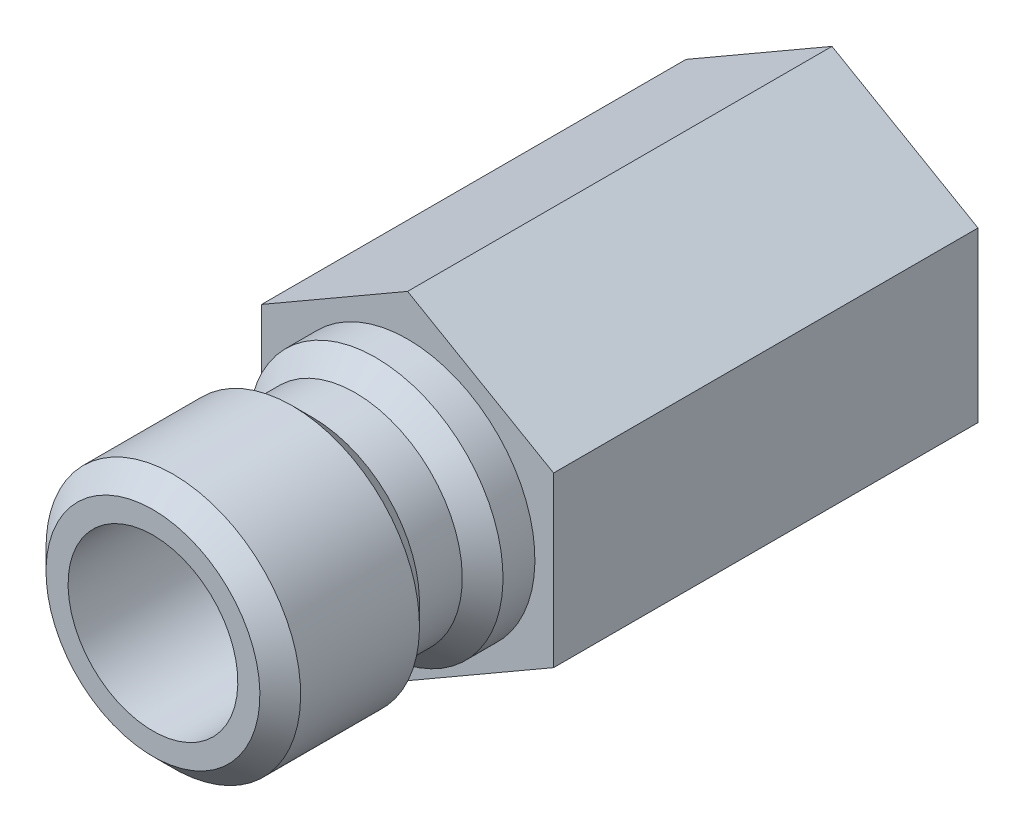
ISO-10303-21;
HEADER;
FILE_DESCRIPTION(('STEP AP214'),'2;1');
FILE_NAME('part.step','',(''),(''),'','','');
FILE_SCHEMA(('AUTOMOTIVE_DESIGN { 1 0 10303 214 1 1 1 1 }'));
ENDSEC;
DATA;
#1=APPLICATION_CONTEXT('core data for automotive mechanical design processes');
#2=APPLICATION_PROTOCOL_DEFINITION('international standard','automotive_design',2000,#1);
#3=PRODUCT_CONTEXT('',#1,'mechanical');
#4=PRODUCT('Part','Part','',(#3));
#5=PRODUCT_RELATED_PRODUCT_CATEGORY('part','',(#4));
#6=PRODUCT_DEFINITION_FORMATION('','',#4);
#7=PRODUCT_DEFINITION_CONTEXT('part definition',#1,'design');
#8=PRODUCT_DEFINITION('design','',#6,#7);
#9=PRODUCT_DEFINITION_SHAPE('','',#8);
#10=(LENGTH_UNIT() NAMED_UNIT(*) SI_UNIT(.MILLI.,.METRE.));
#11=(NAMED_UNIT(*) PLANE_ANGLE_UNIT() SI_UNIT($,.RADIAN.));
#12=(NAMED_UNIT(*) SI_UNIT($,.STERADIAN.) SOLID_ANGLE_UNIT());
#13=UNCERTAINTY_MEASURE_WITH_UNIT(LENGTH_MEASURE(1.E-05),#10,'distance_accuracy_value','');
#14=(GEOMETRIC_REPRESENTATION_CONTEXT(3) GLOBAL_UNCERTAINTY_ASSIGNED_CONTEXT((#13)) GLOBAL_UNIT_ASSIGNED_CONTEXT((#10,
#11,#12)) REPRESENTATION_CONTEXT('',''));
#15=CARTESIAN_POINT('',(0.,0.,0.));
#16=DIRECTION('',(0.,0.,1.));
#17=DIRECTION('',(1.,0.,0.));
#18=AXIS2_PLACEMENT_3D('',#15,#16,#17);
#19=CARTESIAN_POINT('',(0.,6.35,-15.875));
#20=DIRECTION('',(0.,0.,-1.));
#21=DIRECTION('',(0.,1.,0.));
#22=AXIS2_PLACEMENT_3D('',#19,#20,#21);
#23=PLANE('',#22);
#24=CARTESIAN_POINT('',(0.,0.,-15.875));
#25=DIRECTION('',(0.,0.,-1.));
#26=DIRECTION('',(0.,1.,0.));
#27=AXIS2_PLACEMENT_3D('',#24,#25,#26);
#28=CIRCLE('',#27,4.60295448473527);
#29=CARTESIAN_POINT('',(0.,4.60295448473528,-15.875));
#30=VERTEX_POINT('',#29);
#31=EDGE_CURVE('E162',#30,#30,#28,.T.);
#32=ORIENTED_EDGE('',*,*,#31,.F.);
#33=EDGE_LOOP('',(#32));
#34=FACE_BOUND('',#33,.T.);
#35=DIRECTION('',(0.,-1.,0.));
#36=VECTOR('',#35,1.);
#37=CARTESIAN_POINT('',(-5.461,3.15290982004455,-15.875));
#38=LINE('',#37,#36);
#39=CARTESIAN_POINT('',(-5.461,3.15290982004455,-15.875));
#40=VERTEX_POINT('',#39);
#41=CARTESIAN_POINT('',(-5.461,-3.15290982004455,-15.875));
#42=VERTEX_POINT('',#41);
#43=EDGE_CURVE('E104',#40,#42,#38,.T.);
#44=ORIENTED_EDGE('',*,*,#43,.F.);
#45=DIRECTION('',(-0.866025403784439,-0.5,0.));
#46=VECTOR('',#45,1.);
#47=CARTESIAN_POINT('',(0.,6.3058196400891,-15.875));
#48=LINE('',#47,#46);
#49=CARTESIAN_POINT('',(0.,6.3058196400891,-15.875));
#50=VERTEX_POINT('',#49);
#51=EDGE_CURVE('E49',#50,#40,#48,.T.);
#52=ORIENTED_EDGE('',*,*,#51,.F.);
#53=DIRECTION('',(-0.866025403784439,0.5,0.));
#54=VECTOR('',#53,1.);
#55=CARTESIAN_POINT('',(5.461,3.15290982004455,-15.875));
#56=LINE('',#55,#54);
#57=CARTESIAN_POINT('',(5.461,3.15290982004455,-15.875));
#58=VERTEX_POINT('',#57);
#59=EDGE_CURVE('E110',#58,#50,#56,.T.);
#60=ORIENTED_EDGE('',*,*,#59,.F.);
#61=DIRECTION('',(0.,1.,0.));
#62=VECTOR('',#61,1.);
#63=CARTESIAN_POINT('',(5.461,-3.15290982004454,-15.875));
#64=LINE('',#63,#62);
#65=CARTESIAN_POINT('',(5.461,-3.15290982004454,-15.875));
#66=VERTEX_POINT('',#65);
#67=EDGE_CURVE('E108',#66,#58,#64,.T.);
#68=ORIENTED_EDGE('',*,*,#67,.F.);
#69=DIRECTION('',(0.866025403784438,0.5,0.));
#70=VECTOR('',#69,1.);
#71=CARTESIAN_POINT('',(0.,-6.30581964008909,-15.875));
#72=LINE('',#71,#70);
#73=CARTESIAN_POINT('',(0.,-6.30581964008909,-15.875));
#74=VERTEX_POINT('',#73);
#75=EDGE_CURVE('E91',#74,#66,#72,.T.);
#76=ORIENTED_EDGE('',*,*,#75,.F.);
#77=DIRECTION('',(0.866025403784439,-0.5,0.));
#78=VECTOR('',#77,1.);
#79=CARTESIAN_POINT('',(-5.461,-3.15290982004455,-15.875));
#80=LINE('',#79,#78);
#81=EDGE_CURVE('E99',#42,#74,#80,.T.);
#82=ORIENTED_EDGE('',*,*,#81,.F.);
#83=EDGE_LOOP('',(#44,#52,#60,#68,#76,#82));
#84=FACE_BOUND('',#83,.T.);
#85=ADVANCED_FACE('F34',(#34,#84),#23,.T.);
#86=CARTESIAN_POINT('',(0.,4.7625,0.));
#87=DIRECTION('',(0.,0.,1.));
#88=DIRECTION('',(0.,-1.,0.));
#89=AXIS2_PLACEMENT_3D('',#86,#87,#88);
#90=PLANE('',#89);
#91=CARTESIAN_POINT('',(0.,0.,0.));
#92=DIRECTION('',(0.,0.,-1.));
#93=DIRECTION('',(0.,1.,0.));
#94=AXIS2_PLACEMENT_3D('',#91,#92,#93);
#95=CIRCLE('',#94,4.7625);
#96=CARTESIAN_POINT('',(0.,4.7625,0.));
#97=VERTEX_POINT('',#96);
#98=EDGE_CURVE('E159',#97,#97,#95,.T.);
#99=ORIENTED_EDGE('',*,*,#98,.T.);
#100=EDGE_LOOP('',(#99));
#101=FACE_BOUND('',#100,.T.);
#102=DIRECTION('',(-0.866025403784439,0.5,0.));
#103=VECTOR('',#102,1.);
#104=CARTESIAN_POINT('',(5.461,3.15290982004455,0.));
#105=LINE('',#104,#103);
#106=CARTESIAN_POINT('',(5.461,3.15290982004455,0.));
#107=VERTEX_POINT('',#106);
#108=CARTESIAN_POINT('',(0.,6.3058196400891,0.));
#109=VERTEX_POINT('',#108);
#110=EDGE_CURVE('E128',#107,#109,#105,.T.);
#111=ORIENTED_EDGE('',*,*,#110,.T.);
#112=DIRECTION('',(-0.866025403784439,-0.5,0.));
#113=VECTOR('',#112,1.);
#114=CARTESIAN_POINT('',(0.,6.3058196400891,0.));
#115=LINE('',#114,#113);
#116=CARTESIAN_POINT('',(-5.461,3.15290982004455,0.));
#117=VERTEX_POINT('',#116);
#118=EDGE_CURVE('E117',#109,#117,#115,.T.);
#119=ORIENTED_EDGE('',*,*,#118,.T.);
#120=DIRECTION('',(0.,-1.,0.));
#121=VECTOR('',#120,1.);
#122=CARTESIAN_POINT('',(-5.461,3.15290982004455,0.));
#123=LINE('',#122,#121);
#124=CARTESIAN_POINT('',(-5.461,-3.15290982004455,0.));
#125=VERTEX_POINT('',#124);
#126=EDGE_CURVE('E120',#117,#125,#123,.T.);
#127=ORIENTED_EDGE('',*,*,#126,.T.);
#128=DIRECTION('',(0.866025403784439,-0.5,0.));
#129=VECTOR('',#128,1.);
#130=CARTESIAN_POINT('',(-5.461,-3.15290982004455,0.));
#131=LINE('',#130,#129);
#132=CARTESIAN_POINT('',(0.,-6.30581964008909,0.));
#133=VERTEX_POINT('',#132);
#134=EDGE_CURVE('E57',#125,#133,#131,.T.);
#135=ORIENTED_EDGE('',*,*,#134,.T.);
#136=DIRECTION('',(0.866025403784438,0.5,0.));
#137=VECTOR('',#136,1.);
#138=CARTESIAN_POINT('',(0.,-6.30581964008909,0.));
#139=LINE('',#138,#137);
#140=CARTESIAN_POINT('',(5.461,-3.15290982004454,0.));
#141=VERTEX_POINT('',#140);
#142=EDGE_CURVE('E94',#133,#141,#139,.T.);
#143=ORIENTED_EDGE('',*,*,#142,.T.);
#144=DIRECTION('',(0.,1.,0.));
#145=VECTOR('',#144,1.);
#146=CARTESIAN_POINT('',(5.461,-3.15290982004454,0.));
#147=LINE('',#146,#145);
#148=EDGE_CURVE('E125',#141,#107,#147,.T.);
#149=ORIENTED_EDGE('',*,*,#148,.T.);
#150=EDGE_LOOP('',(#111,#119,#127,#135,#143,#149));
#151=FACE_BOUND('',#150,.T.);
#152=ADVANCED_FACE('F184',(#101,#151),#90,.T.);
#153=CARTESIAN_POINT('',(0.,0.,0.));
#154=DIRECTION('',(0.,0.,-1.));
#155=DIRECTION('',(0.,1.,0.));
#156=AXIS2_PLACEMENT_3D('',#153,#154,#155);
#157=CYLINDRICAL_SURFACE('',#156,3.175);
#158=CARTESIAN_POINT('',(0.,0.,-6.35));
#159=DIRECTION('',(0.,0.,-1.));
#160=DIRECTION('',(0.,1.,0.));
#161=AXIS2_PLACEMENT_3D('',#158,#159,#160);
#162=CIRCLE('',#161,3.175);
#163=CARTESIAN_POINT('',(0.,3.175,-6.35));
#164=VERTEX_POINT('',#163);
#165=EDGE_CURVE('E12',#164,#164,#162,.T.);
#166=ORIENTED_EDGE('',*,*,#165,.T.);
#167=EDGE_LOOP('',(#166));
#168=FACE_BOUND('',#167,.T.);
#169=CARTESIAN_POINT('',(0.,0.,9.525));
#170=DIRECTION('',(0.,0.,-1.));
#171=DIRECTION('',(0.,1.,0.));
#172=AXIS2_PLACEMENT_3D('',#169,#170,#171);
#173=CIRCLE('',#172,3.175);
#174=CARTESIAN_POINT('',(0.,3.175,9.525));
#175=VERTEX_POINT('',#174);
#176=EDGE_CURVE('E133',#175,#175,#173,.T.);
#177=ORIENTED_EDGE('',*,*,#176,.F.);
#178=EDGE_LOOP('',(#177));
#179=FACE_BOUND('',#178,.T.);
#180=ADVANCED_FACE('F36',(#168,#179),#157,.F.);
#181=CARTESIAN_POINT('',(0.,3.175,-6.35));
#182=DIRECTION('',(0.,0.,-1.));
#183=DIRECTION('',(0.,1.,0.));
#184=AXIS2_PLACEMENT_3D('',#181,#182,#183);
#185=PLANE('',#184);
#186=CARTESIAN_POINT('',(0.,0.,-6.35));
#187=DIRECTION('',(0.,0.,-1.));
#188=DIRECTION('',(0.,1.,0.));
#189=AXIS2_PLACEMENT_3D('',#186,#187,#188);
#190=CIRCLE('',#189,4.3053);
#191=CARTESIAN_POINT('',(0.,4.3053,-6.35));
#192=VERTEX_POINT('',#191);
#193=EDGE_CURVE('E42',#192,#192,#190,.T.);
#194=ORIENTED_EDGE('',*,*,#193,.T.);
#195=EDGE_LOOP('',(#194));
#196=FACE_BOUND('',#195,.T.);
#197=ORIENTED_EDGE('',*,*,#165,.F.);
#198=EDGE_LOOP('',(#197));
#199=FACE_BOUND('',#198,.T.);
#200=ADVANCED_FACE('F167',(#196,#199),#185,.T.);
#201=CARTESIAN_POINT('',(0.,0.,-6.35));
#202=DIRECTION('',(0.,0.,-1.));
#203=DIRECTION('',(0.,1.,0.));
#204=AXIS2_PLACEMENT_3D('',#201,#202,#203);
#205=CONICAL_SURFACE('',#204,4.3053,0.0312396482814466);
#206=ORIENTED_EDGE('',*,*,#31,.T.);
#207=EDGE_LOOP('',(#206));
#208=FACE_BOUND('',#207,.T.);
#209=ORIENTED_EDGE('',*,*,#193,.F.);
#210=EDGE_LOOP('',(#209));
#211=FACE_BOUND('',#210,.T.);
#212=ADVANCED_FACE('F170',(#208,#211),#205,.F.);
#213=CARTESIAN_POINT('',(0.,0.,0.));
#214=DIRECTION('',(0.,0.,-1.));
#215=DIRECTION('',(0.,1.,0.));
#216=AXIS2_PLACEMENT_3D('',#213,#214,#215);
#217=CYLINDRICAL_SURFACE('',#216,4.7625);
#218=CARTESIAN_POINT('',(0.,0.,1.1938));
#219=DIRECTION('',(0.,0.,-1.));
#220=DIRECTION('',(0.,1.,0.));
#221=AXIS2_PLACEMENT_3D('',#218,#219,#220);
#222=CIRCLE('',#221,4.7625);
#223=CARTESIAN_POINT('',(0.,4.7625,1.1938));
#224=VERTEX_POINT('',#223);
#225=EDGE_CURVE('E156',#224,#224,#222,.T.);
#226=ORIENTED_EDGE('',*,*,#225,.T.);
#227=EDGE_LOOP('',(#226));
#228=FACE_BOUND('',#227,.T.);
#229=ORIENTED_EDGE('',*,*,#98,.F.);
#230=EDGE_LOOP('',(#229));
#231=FACE_BOUND('',#230,.T.);
#232=ADVANCED_FACE('F172',(#228,#231),#217,.T.);
#233=CARTESIAN_POINT('',(0.,0.,1.1938));
#234=DIRECTION('',(0.,0.,-1.));
#235=DIRECTION('',(0.,1.,0.));
#236=AXIS2_PLACEMENT_3D('',#233,#234,#235);
#237=CONICAL_SURFACE('',#236,4.7625,0.785398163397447);
#238=CARTESIAN_POINT('',(0.,0.,1.9558));
#239=DIRECTION('',(0.,0.,-1.));
#240=DIRECTION('',(0.,1.,0.));
#241=AXIS2_PLACEMENT_3D('',#238,#239,#240);
#242=CIRCLE('',#241,4.0005);
#243=CARTESIAN_POINT('',(0.,4.0005,1.9558));
#244=VERTEX_POINT('',#243);
#245=EDGE_CURVE('E153',#244,#244,#242,.T.);
#246=ORIENTED_EDGE('',*,*,#245,.T.);
#247=EDGE_LOOP('',(#246));
#248=FACE_BOUND('',#247,.T.);
#249=ORIENTED_EDGE('',*,*,#225,.F.);
#250=EDGE_LOOP('',(#249));
#251=FACE_BOUND('',#250,.T.);
#252=ADVANCED_FACE('F179',(#248,#251),#237,.T.);
#253=CARTESIAN_POINT('',(0.,0.,0.));
#254=DIRECTION('',(0.,0.,-1.));
#255=DIRECTION('',(0.,1.,0.));
#256=AXIS2_PLACEMENT_3D('',#253,#254,#255);
#257=CYLINDRICAL_SURFACE('',#256,4.0005);
#258=CARTESIAN_POINT('',(0.,0.,3.556));
#259=DIRECTION('',(0.,0.,-1.));
#260=DIRECTION('',(0.,1.,0.));
#261=AXIS2_PLACEMENT_3D('',#258,#259,#260);
#262=CIRCLE('',#261,4.0005);
#263=CARTESIAN_POINT('',(0.,4.0005,3.556));
#264=VERTEX_POINT('',#263);
#265=EDGE_CURVE('E150',#264,#264,#262,.T.);
#266=ORIENTED_EDGE('',*,*,#265,.T.);
#267=EDGE_LOOP('',(#266));
#268=FACE_BOUND('',#267,.T.);
#269=ORIENTED_EDGE('',*,*,#245,.F.);
#270=EDGE_LOOP('',(#269));
#271=FACE_BOUND('',#270,.T.);
#272=ADVANCED_FACE('F195',(#268,#271),#257,.T.);
#273=CARTESIAN_POINT('',(0.,0.,3.556));
#274=DIRECTION('',(0.,0.,1.));
#275=DIRECTION('',(0.,-1.,0.));
#276=AXIS2_PLACEMENT_3D('',#273,#274,#275);
#277=CONICAL_SURFACE('',#276,4.0005,0.785398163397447);
#278=CARTESIAN_POINT('',(0.,0.,4.318));
#279=DIRECTION('',(0.,0.,-1.));
#280=DIRECTION('',(0.,1.,0.));
#281=AXIS2_PLACEMENT_3D('',#278,#279,#280);
#282=CIRCLE('',#281,4.7625);
#283=CARTESIAN_POINT('',(0.,4.7625,4.318));
#284=VERTEX_POINT('',#283);
#285=EDGE_CURVE('E147',#284,#284,#282,.T.);
#286=ORIENTED_EDGE('',*,*,#285,.T.);
#287=EDGE_LOOP('',(#286));
#288=FACE_BOUND('',#287,.T.);
#289=ORIENTED_EDGE('',*,*,#265,.F.);
#290=EDGE_LOOP('',(#289));
#291=FACE_BOUND('',#290,.T.);
#292=ADVANCED_FACE('F199',(#288,#291),#277,.T.);
#293=CARTESIAN_POINT('',(0.,0.,0.));
#294=DIRECTION('',(0.,0.,-1.));
#295=DIRECTION('',(0.,1.,0.));
#296=AXIS2_PLACEMENT_3D('',#293,#294,#295);
#297=CYLINDRICAL_SURFACE('',#296,4.7625);
#298=CARTESIAN_POINT('',(0.,0.,8.763));
#299=DIRECTION('',(0.,0.,-1.));
#300=DIRECTION('',(0.,1.,0.));
#301=AXIS2_PLACEMENT_3D('',#298,#299,#300);
#302=CIRCLE('',#301,4.7625);
#303=CARTESIAN_POINT('',(0.,4.7625,8.763));
#304=VERTEX_POINT('',#303);
#305=EDGE_CURVE('E144',#304,#304,#302,.T.);
#306=ORIENTED_EDGE('',*,*,#305,.T.);
#307=EDGE_LOOP('',(#306));
#308=FACE_BOUND('',#307,.T.);
#309=ORIENTED_EDGE('',*,*,#285,.F.);
#310=EDGE_LOOP('',(#309));
#311=FACE_BOUND('',#310,.T.);
#312=ADVANCED_FACE('F203',(#308,#311),#297,.T.);
#313=CARTESIAN_POINT('',(0.,0.,8.763));
#314=DIRECTION('',(0.,0.,-1.));
#315=DIRECTION('',(0.,1.,0.));
#316=AXIS2_PLACEMENT_3D('',#313,#314,#315);
#317=CONICAL_SURFACE('',#316,4.7625,0.785398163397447);
#318=CARTESIAN_POINT('',(0.,0.,9.525));
#319=DIRECTION('',(0.,0.,-1.));
#320=DIRECTION('',(0.,1.,0.));
#321=AXIS2_PLACEMENT_3D('',#318,#319,#320);
#322=CIRCLE('',#321,4.0005);
#323=CARTESIAN_POINT('',(0.,4.0005,9.525));
#324=VERTEX_POINT('',#323);
#325=EDGE_CURVE('E141',#324,#324,#322,.T.);
#326=ORIENTED_EDGE('',*,*,#325,.T.);
#327=EDGE_LOOP('',(#326));
#328=FACE_BOUND('',#327,.T.);
#329=ORIENTED_EDGE('',*,*,#305,.F.);
#330=EDGE_LOOP('',(#329));
#331=FACE_BOUND('',#330,.T.);
#332=ADVANCED_FACE('F207',(#328,#331),#317,.T.);
#333=CARTESIAN_POINT('',(0.,3.175,9.525));
#334=DIRECTION('',(0.,0.,1.));
#335=DIRECTION('',(0.,-1.,0.));
#336=AXIS2_PLACEMENT_3D('',#333,#334,#335);
#337=PLANE('',#336);
#338=ORIENTED_EDGE('',*,*,#176,.T.);
#339=EDGE_LOOP('',(#338));
#340=FACE_BOUND('',#339,.T.);
#341=ORIENTED_EDGE('',*,*,#325,.F.);
#342=EDGE_LOOP('',(#341));
#343=FACE_BOUND('',#342,.T.);
#344=ADVANCED_FACE('F211',(#340,#343),#337,.T.);
#345=CARTESIAN_POINT('',(0.,6.3058196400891,-15.875));
#346=DIRECTION('',(-0.5,0.866025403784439,0.));
#347=DIRECTION('',(-0.866025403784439,-0.5,0.));
#348=AXIS2_PLACEMENT_3D('',#345,#346,#347);
#349=PLANE('',#348);
#350=ORIENTED_EDGE('',*,*,#118,.F.);
#351=DIRECTION('',(0.,0.,1.));
#352=VECTOR('',#351,1.);
#353=CARTESIAN_POINT('',(0.,6.3058196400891,-15.875));
#354=LINE('',#353,#352);
#355=EDGE_CURVE('E131',#50,#109,#354,.T.);
#356=ORIENTED_EDGE('',*,*,#355,.F.);
#357=ORIENTED_EDGE('',*,*,#51,.T.);
#358=DIRECTION('',(0.,0.,1.));
#359=VECTOR('',#358,1.);
#360=CARTESIAN_POINT('',(-5.461,3.15290982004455,-15.875));
#361=LINE('',#360,#359);
#362=EDGE_CURVE('E116',#40,#117,#361,.T.);
#363=ORIENTED_EDGE('',*,*,#362,.T.);
#364=EDGE_LOOP('',(#350,#356,#357,#363));
#365=FACE_BOUND('',#364,.T.);
#366=ADVANCED_FACE('F215',(#365),#349,.T.);
#367=CARTESIAN_POINT('',(5.461,3.15290982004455,-15.875));
#368=DIRECTION('',(0.5,0.866025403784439,0.));
#369=DIRECTION('',(-0.866025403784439,0.5,0.));
#370=AXIS2_PLACEMENT_3D('',#367,#368,#369);
#371=PLANE('',#370);
#372=ORIENTED_EDGE('',*,*,#110,.F.);
#373=DIRECTION('',(0.,0.,1.));
#374=VECTOR('',#373,1.);
#375=CARTESIAN_POINT('',(5.461,3.15290982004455,-15.875));
#376=LINE('',#375,#374);
#377=EDGE_CURVE('E134',#58,#107,#376,.T.);
#378=ORIENTED_EDGE('',*,*,#377,.F.);
#379=ORIENTED_EDGE('',*,*,#59,.T.);
#380=ORIENTED_EDGE('',*,*,#355,.T.);
#381=EDGE_LOOP('',(#372,#378,#379,#380));
#382=FACE_BOUND('',#381,.T.);
#383=ADVANCED_FACE('F219',(#382),#371,.T.);
#384=CARTESIAN_POINT('',(5.461,-3.15290982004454,-15.875));
#385=DIRECTION('',(1.,0.,0.));
#386=DIRECTION('',(0.,1.,0.));
#387=AXIS2_PLACEMENT_3D('',#384,#385,#386);
#388=PLANE('',#387);
#389=ORIENTED_EDGE('',*,*,#148,.F.);
#390=DIRECTION('',(0.,0.,1.));
#391=VECTOR('',#390,1.);
#392=CARTESIAN_POINT('',(5.461,-3.15290982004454,-15.875));
#393=LINE('',#392,#391);
#394=EDGE_CURVE('E95',#66,#141,#393,.T.);
#395=ORIENTED_EDGE('',*,*,#394,.F.);
#396=ORIENTED_EDGE('',*,*,#67,.T.);
#397=ORIENTED_EDGE('',*,*,#377,.T.);
#398=EDGE_LOOP('',(#389,#395,#396,#397));
#399=FACE_BOUND('',#398,.T.);
#400=ADVANCED_FACE('F228',(#399),#388,.T.);
#401=CARTESIAN_POINT('',(0.,-6.30581964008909,-15.875));
#402=DIRECTION('',(0.5,-0.866025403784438,0.));
#403=DIRECTION('',(0.866025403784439,0.5,0.));
#404=AXIS2_PLACEMENT_3D('',#401,#402,#403);
#405=PLANE('',#404);
#406=ORIENTED_EDGE('',*,*,#142,.F.);
#407=DIRECTION('',(0.,0.,1.));
#408=VECTOR('',#407,1.);
#409=CARTESIAN_POINT('',(0.,-6.30581964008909,-15.875));
#410=LINE('',#409,#408);
#411=EDGE_CURVE('E87',#74,#133,#410,.T.);
#412=ORIENTED_EDGE('',*,*,#411,.F.);
#413=ORIENTED_EDGE('',*,*,#75,.T.);
#414=ORIENTED_EDGE('',*,*,#394,.T.);
#415=EDGE_LOOP('',(#406,#412,#413,#414));
#416=FACE_BOUND('',#415,.T.);
#417=ADVANCED_FACE('F89',(#416),#405,.T.);
#418=CARTESIAN_POINT('',(-5.461,-3.15290982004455,-15.875));
#419=DIRECTION('',(-0.5,-0.866025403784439,0.));
#420=DIRECTION('',(0.866025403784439,-0.5,0.));
#421=AXIS2_PLACEMENT_3D('',#418,#419,#420);
#422=PLANE('',#421);
#423=ORIENTED_EDGE('',*,*,#134,.F.);
#424=DIRECTION('',(0.,0.,1.));
#425=VECTOR('',#424,1.);
#426=CARTESIAN_POINT('',(-5.461,-3.15290982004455,-15.875));
#427=LINE('',#426,#425);
#428=EDGE_CURVE('E96',#42,#125,#427,.T.);
#429=ORIENTED_EDGE('',*,*,#428,.F.);
#430=ORIENTED_EDGE('',*,*,#81,.T.);
#431=ORIENTED_EDGE('',*,*,#411,.T.);
#432=EDGE_LOOP('',(#423,#429,#430,#431));
#433=FACE_BOUND('',#432,.T.);
#434=ADVANCED_FACE('F100',(#433),#422,.T.);
#435=CARTESIAN_POINT('',(-5.461,3.15290982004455,-15.875));
#436=DIRECTION('',(-1.,0.,0.));
#437=DIRECTION('',(0.,0.,1.));
#438=AXIS2_PLACEMENT_3D('',#435,#436,#437);
#439=PLANE('',#438);
#440=ORIENTED_EDGE('',*,*,#126,.F.);
#441=ORIENTED_EDGE('',*,*,#362,.F.);
#442=ORIENTED_EDGE('',*,*,#43,.T.);
#443=ORIENTED_EDGE('',*,*,#428,.T.);
#444=EDGE_LOOP('',(#440,#441,#442,#443));
#445=FACE_BOUND('',#444,.T.);
#446=ADVANCED_FACE('F220',(#445),#439,.T.);
#447=CLOSED_SHELL('',(#85,#152,#180,#200,#212,#232,#252,#272,#292,#312,#332,#344,#366,#383,#400,
#417,#434,#446));
#448=MANIFOLD_SOLID_BREP('B2',#447);
#449=ADVANCED_BREP_SHAPE_REPRESENTATION('',(#18,#448),#14);
#450=SHAPE_DEFINITION_REPRESENTATION(#9,#449);
ENDSEC;
END-ISO-10303-21;
